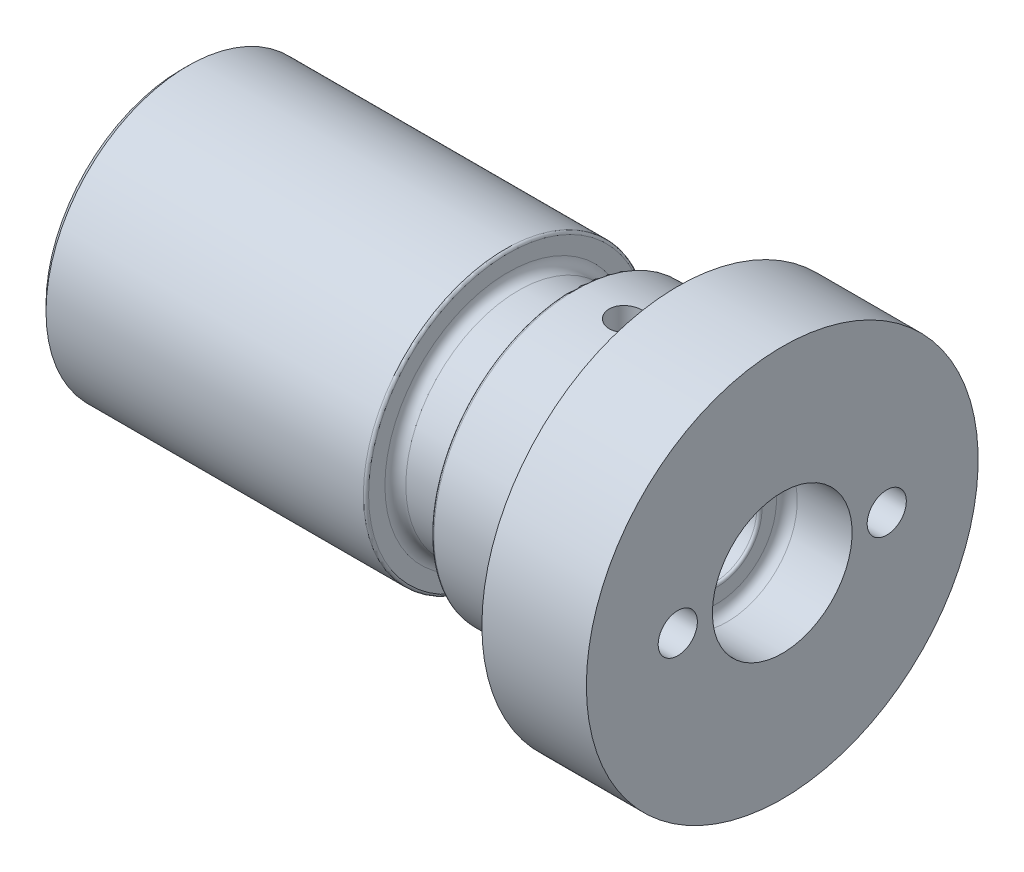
ISO-10303-21;
HEADER;
FILE_DESCRIPTION(('STEP AP214'),'2;1');
FILE_NAME('part.step','',(''),(''),'','','');
FILE_SCHEMA(('AUTOMOTIVE_DESIGN { 1 0 10303 214 1 1 1 1 }'));
ENDSEC;
DATA;
#1=APPLICATION_CONTEXT('core data for automotive mechanical design processes');
#2=APPLICATION_PROTOCOL_DEFINITION('international standard','automotive_design',2000,#1);
#3=PRODUCT_CONTEXT('',#1,'mechanical');
#4=PRODUCT('Part','Part','',(#3));
#5=PRODUCT_RELATED_PRODUCT_CATEGORY('part','',(#4));
#6=PRODUCT_DEFINITION_FORMATION('','',#4);
#7=PRODUCT_DEFINITION_CONTEXT('part definition',#1,'design');
#8=PRODUCT_DEFINITION('design','',#6,#7);
#9=PRODUCT_DEFINITION_SHAPE('','',#8);
#10=(LENGTH_UNIT() NAMED_UNIT(*) SI_UNIT(.MILLI.,.METRE.));
#11=(NAMED_UNIT(*) PLANE_ANGLE_UNIT() SI_UNIT($,.RADIAN.));
#12=(NAMED_UNIT(*) SI_UNIT($,.STERADIAN.) SOLID_ANGLE_UNIT());
#13=UNCERTAINTY_MEASURE_WITH_UNIT(LENGTH_MEASURE(1.E-05),#10,'distance_accuracy_value','');
#14=(GEOMETRIC_REPRESENTATION_CONTEXT(3) GLOBAL_UNCERTAINTY_ASSIGNED_CONTEXT((#13)) GLOBAL_UNIT_ASSIGNED_CONTEXT((#10,
#11,#12)) REPRESENTATION_CONTEXT('',''));
#15=CARTESIAN_POINT('',(0.,0.,0.));
#16=DIRECTION('',(0.,0.,1.));
#17=DIRECTION('',(1.,0.,0.));
#18=AXIS2_PLACEMENT_3D('',#15,#16,#17);
#19=CARTESIAN_POINT('',(0.,0.,0.));
#20=DIRECTION('',(-1.00000000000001,0.,0.));
#21=DIRECTION('',(0.,0.,1.));
#22=AXIS2_PLACEMENT_3D('',#19,#20,#21);
#23=CYLINDRICAL_SURFACE('',#22,10.875);
#24=CARTESIAN_POINT('',(24.8000000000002,0.,0.));
#25=DIRECTION('',(-1.00000000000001,0.,0.));
#26=DIRECTION('',(0.,0.,1.));
#27=AXIS2_PLACEMENT_3D('',#24,#25,#26);
#28=CIRCLE('',#27,10.875);
#29=CARTESIAN_POINT('',(24.8000000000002,0.,10.875));
#30=VERTEX_POINT('',#29);
#31=EDGE_CURVE('E203',#30,#30,#28,.T.);
#32=ORIENTED_EDGE('',*,*,#31,.T.);
#33=EDGE_LOOP('',(#32));
#34=FACE_BOUND('',#33,.T.);
#35=CARTESIAN_POINT('',(0.5,0.,0.));
#36=DIRECTION('',(1.00000000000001,0.,0.));
#37=DIRECTION('',(0.,0.,-1.));
#38=AXIS2_PLACEMENT_3D('',#35,#36,#37);
#39=CIRCLE('',#38,10.875);
#40=CARTESIAN_POINT('',(0.500000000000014,0.,-10.875));
#41=VERTEX_POINT('',#40);
#42=EDGE_CURVE('E206',#41,#41,#39,.T.);
#43=ORIENTED_EDGE('',*,*,#42,.T.);
#44=EDGE_LOOP('',(#43));
#45=FACE_BOUND('',#44,.T.);
#46=ADVANCED_FACE('F40',(#34,#45),#23,.T.);
#47=CARTESIAN_POINT('',(25.0000000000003,10.875,0.));
#48=DIRECTION('',(-1.00000000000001,0.,0.));
#49=DIRECTION('',(0.,0.,1.));
#50=AXIS2_PLACEMENT_3D('',#47,#48,#49);
#51=PLANE('',#50);
#52=CARTESIAN_POINT('',(25.0000000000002,0.,0.));
#53=DIRECTION('',(-1.00000000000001,0.,0.));
#54=DIRECTION('',(0.,0.,1.));
#55=AXIS2_PLACEMENT_3D('',#52,#53,#54);
#56=CIRCLE('',#55,10.675);
#57=CARTESIAN_POINT('',(25.0000000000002,0.,10.675));
#58=VERTEX_POINT('',#57);
#59=EDGE_CURVE('E373',#58,#58,#56,.F.);
#60=ORIENTED_EDGE('',*,*,#59,.T.);
#61=EDGE_LOOP('',(#60));
#62=FACE_BOUND('',#61,.T.);
#63=CARTESIAN_POINT('',(25.0000000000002,0.,0.));
#64=DIRECTION('',(-1.00000000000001,0.,0.));
#65=DIRECTION('',(0.,0.,1.));
#66=AXIS2_PLACEMENT_3D('',#63,#64,#65);
#67=CIRCLE('',#66,9.425);
#68=CARTESIAN_POINT('',(25.0000000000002,0.,9.42499999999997));
#69=VERTEX_POINT('',#68);
#70=EDGE_CURVE('E355',#69,#69,#67,.T.);
#71=ORIENTED_EDGE('',*,*,#70,.T.);
#72=EDGE_LOOP('',(#71));
#73=FACE_BOUND('',#72,.T.);
#74=ADVANCED_FACE('F193',(#62,#73),#51,.F.);
#75=CARTESIAN_POINT('',(0.,0.,0.));
#76=DIRECTION('',(-1.00000000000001,0.,0.));
#77=DIRECTION('',(0.,0.,1.));
#78=AXIS2_PLACEMENT_3D('',#75,#76,#77);
#79=CYLINDRICAL_SURFACE('',#78,8.625);
#80=CARTESIAN_POINT('',(29.2000000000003,0.,0.));
#81=DIRECTION('',(1.00000000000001,0.,0.));
#82=DIRECTION('',(0.,0.,-1.));
#83=AXIS2_PLACEMENT_3D('',#80,#81,#82);
#84=CIRCLE('',#83,8.625);
#85=CARTESIAN_POINT('',(29.2000000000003,0.,-8.62500000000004));
#86=VERTEX_POINT('',#85);
#87=EDGE_CURVE('E212',#86,#86,#84,.F.);
#88=ORIENTED_EDGE('',*,*,#87,.T.);
#89=EDGE_LOOP('',(#88));
#90=FACE_BOUND('',#89,.T.);
#91=CARTESIAN_POINT('',(25.8000000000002,0.,0.));
#92=DIRECTION('',(-1.00000000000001,0.,0.));
#93=DIRECTION('',(0.,0.,1.));
#94=AXIS2_PLACEMENT_3D('',#91,#92,#93);
#95=CIRCLE('',#94,8.625);
#96=CARTESIAN_POINT('',(25.8000000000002,0.,8.62499999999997));
#97=VERTEX_POINT('',#96);
#98=EDGE_CURVE('E208',#97,#97,#95,.F.);
#99=ORIENTED_EDGE('',*,*,#98,.T.);
#100=EDGE_LOOP('',(#99));
#101=FACE_BOUND('',#100,.T.);
#102=ADVANCED_FACE('F198',(#90,#101),#79,.T.);
#103=CARTESIAN_POINT('',(30.0000000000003,8.62500000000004,0.));
#104=DIRECTION('',(1.00000000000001,0.,0.));
#105=DIRECTION('',(0.,0.,-1.));
#106=AXIS2_PLACEMENT_3D('',#103,#104,#105);
#107=PLANE('',#106);
#108=CARTESIAN_POINT('',(30.0000000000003,0.,0.));
#109=DIRECTION('',(1.00000000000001,0.,0.));
#110=DIRECTION('',(0.,0.,-1.));
#111=AXIS2_PLACEMENT_3D('',#108,#109,#110);
#112=CIRCLE('',#111,10.675);
#113=CARTESIAN_POINT('',(30.0000000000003,0.,-10.675));
#114=VERTEX_POINT('',#113);
#115=EDGE_CURVE('E47',#114,#114,#112,.F.);
#116=ORIENTED_EDGE('',*,*,#115,.T.);
#117=EDGE_LOOP('',(#116));
#118=FACE_BOUND('',#117,.T.);
#119=CARTESIAN_POINT('',(30.0000000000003,0.,0.));
#120=DIRECTION('',(1.00000000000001,0.,0.));
#121=DIRECTION('',(0.,0.,-1.));
#122=AXIS2_PLACEMENT_3D('',#119,#120,#121);
#123=CIRCLE('',#122,9.425);
#124=CARTESIAN_POINT('',(30.0000000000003,0.,-9.42500000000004));
#125=VERTEX_POINT('',#124);
#126=EDGE_CURVE('E351',#125,#125,#123,.T.);
#127=ORIENTED_EDGE('',*,*,#126,.T.);
#128=EDGE_LOOP('',(#127));
#129=FACE_BOUND('',#128,.T.);
#130=ADVANCED_FACE('F280',(#118,#129),#107,.F.);
#131=CARTESIAN_POINT('',(0.,0.,0.));
#132=DIRECTION('',(-1.00000000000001,0.,0.));
#133=DIRECTION('',(0.,0.,1.));
#134=AXIS2_PLACEMENT_3D('',#131,#132,#133);
#135=CYLINDRICAL_SURFACE('',#134,10.875);
#136=CARTESIAN_POINT('',(30.2000000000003,0.,0.));
#137=DIRECTION('',(1.00000000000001,0.,0.));
#138=DIRECTION('',(0.,0.,-1.));
#139=AXIS2_PLACEMENT_3D('',#136,#137,#138);
#140=CIRCLE('',#139,10.875);
#141=CARTESIAN_POINT('',(30.2000000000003,0.,-10.875));
#142=VERTEX_POINT('',#141);
#143=EDGE_CURVE('E11',#142,#142,#140,.T.);
#144=ORIENTED_EDGE('',*,*,#143,.T.);
#145=EDGE_LOOP('',(#144));
#146=FACE_BOUND('',#145,.T.);
#147=CARTESIAN_POINT('',(34.0000000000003,-10.8029220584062,-1.25000000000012));
#148=CARTESIAN_POINT('',(33.9300362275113,-10.8029229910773,-1.24999699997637));
#149=CARTESIAN_POINT('',(33.8600276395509,-10.8036090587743,-1.24410628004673));
#150=CARTESIAN_POINT('',(33.7219556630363,-10.8062784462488,-1.22069838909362));
#151=CARTESIAN_POINT('',(33.6538944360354,-10.8082631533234,-1.20316878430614));
#152=CARTESIAN_POINT('',(33.5217364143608,-10.8133021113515,-1.15700398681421));
#153=CARTESIAN_POINT('',(33.457637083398,-10.8163556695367,-1.12837598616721));
#154=CARTESIAN_POINT('',(33.3351655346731,-10.8231874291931,-1.06084179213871));
#155=CARTESIAN_POINT('',(33.2767922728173,-10.8269654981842,-1.02193747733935));
#156=CARTESIAN_POINT('',(33.167139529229,-10.8348407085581,-0.93475663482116));
#157=CARTESIAN_POINT('',(33.1158911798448,-10.838939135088,-0.886441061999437));
#158=CARTESIAN_POINT('',(33.0222115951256,-10.8469816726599,-0.781893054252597));
#159=CARTESIAN_POINT('',(32.9797807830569,-10.8509257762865,-0.725660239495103));
#160=CARTESIAN_POINT('',(32.9048305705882,-10.8582282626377,-0.606680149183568));
#161=CARTESIAN_POINT('',(32.8723391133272,-10.8615849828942,-0.543915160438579));
#162=CARTESIAN_POINT('',(32.818368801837,-10.8673204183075,-0.413774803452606));
#163=CARTESIAN_POINT('',(32.7968895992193,-10.8696991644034,-0.346399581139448));
#164=CARTESIAN_POINT('',(32.7656458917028,-10.8732015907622,-0.209268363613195));
#165=CARTESIAN_POINT('',(32.7558298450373,-10.8743307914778,-0.139524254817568));
#166=CARTESIAN_POINT('',(32.7480314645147,-10.8752257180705,0.000629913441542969));
#167=CARTESIAN_POINT('',(32.7500487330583,-10.8749914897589,0.0710399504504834));
#168=CARTESIAN_POINT('',(32.7658181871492,-10.8731904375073,0.210176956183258));
#169=CARTESIAN_POINT('',(32.7795149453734,-10.871629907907,0.278910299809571));
#170=CARTESIAN_POINT('',(32.8181680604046,-10.8673587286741,0.413096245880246));
#171=CARTESIAN_POINT('',(32.8431246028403,-10.8646480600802,0.478548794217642));
#172=CARTESIAN_POINT('',(32.9036485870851,-10.8583704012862,0.604488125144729));
#173=CARTESIAN_POINT('',(32.9392402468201,-10.8548014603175,0.664963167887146));
#174=CARTESIAN_POINT('',(33.0200065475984,-10.8472070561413,0.779102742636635));
#175=CARTESIAN_POINT('',(33.0651815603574,-10.8431815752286,0.832767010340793));
#176=CARTESIAN_POINT('',(33.16414321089,-10.8350976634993,0.932086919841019));
#177=CARTESIAN_POINT('',(33.2179781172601,-10.8310391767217,0.977694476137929));
#178=CARTESIAN_POINT('',(33.3325649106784,-10.8233697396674,1.05923323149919));
#179=CARTESIAN_POINT('',(33.3933168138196,-10.819758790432,1.09516440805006));
#180=CARTESIAN_POINT('',(33.5200533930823,-10.8133931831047,1.15633191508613));
#181=CARTESIAN_POINT('',(33.5860397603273,-10.8106388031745,1.18156477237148));
#182=CARTESIAN_POINT('',(33.7213516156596,-10.8063037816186,1.22057870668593));
#183=CARTESIAN_POINT('',(33.790676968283,-10.8047230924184,1.2343602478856));
#184=CARTESIAN_POINT('',(33.9302753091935,-10.8029229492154,1.25001744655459));
#185=CARTESIAN_POINT('',(34.0005406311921,-10.8026957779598,1.25196060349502));
#186=CARTESIAN_POINT('',(34.1403958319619,-10.8036080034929,1.24406361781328));
#187=CARTESIAN_POINT('',(34.2099857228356,-10.80474737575,1.23422368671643));
#188=CARTESIAN_POINT('',(34.3463147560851,-10.808257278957,1.20309652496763));
#189=CARTESIAN_POINT('',(34.4130613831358,-10.8106243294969,1.1818416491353));
#190=CARTESIAN_POINT('',(34.5420427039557,-10.8163200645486,1.12852113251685));
#191=CARTESIAN_POINT('',(34.6042772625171,-10.8196487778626,1.09645516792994));
#192=CARTESIAN_POINT('',(34.7227742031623,-10.82691135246,1.02225540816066));
#193=CARTESIAN_POINT('',(34.7790085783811,-10.8308478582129,0.980077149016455));
#194=CARTESIAN_POINT('',(34.8836238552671,-10.8388740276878,0.886913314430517));
#195=CARTESIAN_POINT('',(34.9320044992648,-10.8429636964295,0.83592745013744));
#196=CARTESIAN_POINT('',(35.0197742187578,-10.8508589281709,0.726301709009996));
#197=CARTESIAN_POINT('',(35.0591190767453,-10.8546630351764,0.667626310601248));
#198=CARTESIAN_POINT('',(35.12739513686,-10.8615370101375,0.544460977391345));
#199=CARTESIAN_POINT('',(35.1563265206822,-10.8646068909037,0.479971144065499));
#200=CARTESIAN_POINT('',(35.2028805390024,-10.8696600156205,0.34715767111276));
#201=CARTESIAN_POINT('',(35.2205292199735,-10.8716457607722,0.278843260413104));
#202=CARTESIAN_POINT('',(35.2441017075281,-10.8743172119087,0.140196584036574));
#203=CARTESIAN_POINT('',(35.2500259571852,-10.8750029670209,0.0698643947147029));
#204=CARTESIAN_POINT('',(35.2499740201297,-10.8749970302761,-0.070388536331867));
#205=CARTESIAN_POINT('',(35.2440662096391,-10.8743132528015,-0.140309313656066));
#206=CARTESIAN_POINT('',(35.2206620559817,-10.8716607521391,-0.278157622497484));
#207=CARTESIAN_POINT('',(35.2031657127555,-10.8696920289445,-0.346085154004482));
#208=CARTESIAN_POINT('',(35.1571015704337,-10.8646899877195,-0.47801335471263));
#209=CARTESIAN_POINT('',(35.1285365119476,-10.8616569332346,-0.54201499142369));
#210=CARTESIAN_POINT('',(35.0611529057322,-10.8548630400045,-0.664326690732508));
#211=CARTESIAN_POINT('',(35.0223343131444,-10.8511021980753,-0.722636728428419));
#212=CARTESIAN_POINT('',(34.9352908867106,-10.8432472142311,-0.832259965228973));
#213=CARTESIAN_POINT('',(34.8870151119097,-10.8391513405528,-0.883532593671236));
#214=CARTESIAN_POINT('',(34.7825319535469,-10.831102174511,-0.977277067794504));
#215=CARTESIAN_POINT('',(34.726322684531,-10.8271489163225,-1.01974681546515));
#216=CARTESIAN_POINT('',(34.6073597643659,-10.8198187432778,-1.09479596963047));
#217=CARTESIAN_POINT('',(34.5445852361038,-10.8164437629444,-1.12734245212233));
#218=CARTESIAN_POINT('',(34.4144602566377,-10.8106750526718,-1.18138701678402));
#219=CARTESIAN_POINT('',(34.3471149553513,-10.8082802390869,-1.2028973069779));
#220=CARTESIAN_POINT('',(34.2328388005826,-10.8053341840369,-1.2290167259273));
#221=CARTESIAN_POINT('',(34.1866332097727,-10.804434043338,-1.23687438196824));
#222=CARTESIAN_POINT('',(34.0936251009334,-10.8032276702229,-1.24736700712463));
#223=CARTESIAN_POINT('',(34.0468225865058,-10.802921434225,-1.25000200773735));
#224=CARTESIAN_POINT('',(34.0000000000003,-10.8029220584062,-1.25000000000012));
#225=B_SPLINE_CURVE_WITH_KNOTS('',3,(#147,#148,#149,#150,#151,#152,#153,#154,#155,#156,#157,
#158,#159,#160,#161,#162,#163,#164,#165,#166,#167,#168,#169,#170,#171,#172,#173,#174,#175,#176,
#177,#178,#179,#180,#181,#182,#183,#184,#185,#186,#187,#188,#189,#190,#191,#192,#193,#194,#195,
#196,#197,#198,#199,#200,#201,#202,#203,#204,#205,#206,#207,#208,#209,#210,#211,#212,#213,#214,
#215,#216,#217,#218,#219,#220,#221,#222,#223,#224),.UNSPECIFIED.,.T.,.F.,(4,2,2,2,2,2,2,2,2,2,2,
2,2,2,2,2,2,2,2,2,2,2,2,2,2,2,2,2,2,2,2,2,2,2,2,2,2,2,4),(0.,0.209720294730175,
0.419664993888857,0.629473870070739,0.839244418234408,1.04990454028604,1.26057477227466,
1.47183194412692,1.68308243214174,1.89339584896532,2.10370219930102,2.31301601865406,
2.52233328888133,2.73213088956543,2.94193662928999,3.1529551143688,3.3639740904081,
3.57506152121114,3.78614039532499,3.99601461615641,4.20588506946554,4.4151637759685,
4.62444875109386,4.83467140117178,5.04490094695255,5.25613833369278,5.46737203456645,
5.67811631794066,5.88885263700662,6.09837464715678,6.30789665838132,6.51736682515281,
6.72683790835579,6.93746996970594,7.14815217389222,7.35952597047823,7.57066544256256,
7.71101959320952,7.85137289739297),.UNSPECIFIED.);
#226=CARTESIAN_POINT('',(34.0000000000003,-10.8029220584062,-1.25000000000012));
#227=VERTEX_POINT('',#226);
#228=EDGE_CURVE('E131',#227,#227,#225,.T.);
#229=ORIENTED_EDGE('',*,*,#228,.T.);
#230=EDGE_LOOP('',(#229));
#231=FACE_BOUND('',#230,.T.);
#232=CARTESIAN_POINT('',(34.0000000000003,10.8029220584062,1.24999999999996));
#233=CARTESIAN_POINT('',(33.9300362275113,10.8029229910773,1.24999699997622));
#234=CARTESIAN_POINT('',(33.8600276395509,10.8036090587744,1.24410628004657));
#235=CARTESIAN_POINT('',(33.7219556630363,10.8062784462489,1.22069838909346));
#236=CARTESIAN_POINT('',(33.6538944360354,10.8082631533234,1.20316878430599));
#237=CARTESIAN_POINT('',(33.5217364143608,10.8133021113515,1.15700398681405));
#238=CARTESIAN_POINT('',(33.457637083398,10.8163556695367,1.12837598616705));
#239=CARTESIAN_POINT('',(33.3351655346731,10.8231874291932,1.06084179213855));
#240=CARTESIAN_POINT('',(33.2767922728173,10.8269654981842,1.02193747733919));
#241=CARTESIAN_POINT('',(33.167139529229,10.8348407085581,0.934756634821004));
#242=CARTESIAN_POINT('',(33.1158911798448,10.8389391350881,0.886441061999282));
#243=CARTESIAN_POINT('',(33.0222115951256,10.8469816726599,0.78189305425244));
#244=CARTESIAN_POINT('',(32.9797807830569,10.8509257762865,0.725660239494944));
#245=CARTESIAN_POINT('',(32.9048305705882,10.8582282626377,0.606680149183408));
#246=CARTESIAN_POINT('',(32.8723391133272,10.8615849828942,0.543915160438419));
#247=CARTESIAN_POINT('',(32.818368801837,10.8673204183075,0.413774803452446));
#248=CARTESIAN_POINT('',(32.7968895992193,10.8696991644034,0.346399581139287));
#249=CARTESIAN_POINT('',(32.7656458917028,10.8732015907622,0.209268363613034));
#250=CARTESIAN_POINT('',(32.7558298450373,10.8743307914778,0.139524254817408));
#251=CARTESIAN_POINT('',(32.7480314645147,10.8752257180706,-0.000629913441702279));
#252=CARTESIAN_POINT('',(32.7500487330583,10.8749914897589,-0.0710399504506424));
#253=CARTESIAN_POINT('',(32.7658181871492,10.8731904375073,-0.210176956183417));
#254=CARTESIAN_POINT('',(32.7795149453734,10.8716299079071,-0.278910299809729));
#255=CARTESIAN_POINT('',(32.8181680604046,10.8673587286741,-0.413096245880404));
#256=CARTESIAN_POINT('',(32.8431246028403,10.8646480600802,-0.478548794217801));
#257=CARTESIAN_POINT('',(32.9036485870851,10.8583704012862,-0.604488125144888));
#258=CARTESIAN_POINT('',(32.9392402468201,10.8548014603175,-0.664963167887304));
#259=CARTESIAN_POINT('',(33.0200065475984,10.8472070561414,-0.779102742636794));
#260=CARTESIAN_POINT('',(33.0651815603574,10.8431815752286,-0.832767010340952));
#261=CARTESIAN_POINT('',(33.16414321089,10.8350976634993,-0.932086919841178));
#262=CARTESIAN_POINT('',(33.2179781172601,10.8310391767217,-0.977694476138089));
#263=CARTESIAN_POINT('',(33.3325649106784,10.8233697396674,-1.05923323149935));
#264=CARTESIAN_POINT('',(33.3933168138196,10.819758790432,-1.09516440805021));
#265=CARTESIAN_POINT('',(33.5200533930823,10.8133931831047,-1.15633191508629));
#266=CARTESIAN_POINT('',(33.5860397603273,10.8106388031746,-1.18156477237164));
#267=CARTESIAN_POINT('',(33.7213516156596,10.8063037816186,-1.22057870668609));
#268=CARTESIAN_POINT('',(33.790676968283,10.8047230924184,-1.23436024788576));
#269=CARTESIAN_POINT('',(33.9302753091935,10.8029229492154,-1.25001744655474));
#270=CARTESIAN_POINT('',(34.0005406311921,10.8026957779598,-1.25196060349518));
#271=CARTESIAN_POINT('',(34.1403958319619,10.8036080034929,-1.24406361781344));
#272=CARTESIAN_POINT('',(34.2099857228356,10.80474737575,-1.23422368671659));
#273=CARTESIAN_POINT('',(34.3463147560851,10.808257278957,-1.20309652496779));
#274=CARTESIAN_POINT('',(34.4130613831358,10.8106243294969,-1.18184164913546));
#275=CARTESIAN_POINT('',(34.5420427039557,10.8163200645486,-1.12852113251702));
#276=CARTESIAN_POINT('',(34.6042772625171,10.8196487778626,-1.09645516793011));
#277=CARTESIAN_POINT('',(34.7227742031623,10.82691135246,-1.02225540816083));
#278=CARTESIAN_POINT('',(34.7790085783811,10.8308478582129,-0.980077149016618));
#279=CARTESIAN_POINT('',(34.883623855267,10.8388740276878,-0.886913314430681));
#280=CARTESIAN_POINT('',(34.9320044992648,10.8429636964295,-0.835927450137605));
#281=CARTESIAN_POINT('',(35.0197742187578,10.8508589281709,-0.726301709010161));
#282=CARTESIAN_POINT('',(35.0591190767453,10.8546630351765,-0.667626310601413));
#283=CARTESIAN_POINT('',(35.12739513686,10.8615370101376,-0.544460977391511));
#284=CARTESIAN_POINT('',(35.1563265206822,10.8646068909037,-0.479971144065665));
#285=CARTESIAN_POINT('',(35.2028805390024,10.8696600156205,-0.347157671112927));
#286=CARTESIAN_POINT('',(35.2205292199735,10.8716457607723,-0.278843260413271));
#287=CARTESIAN_POINT('',(35.2441017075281,10.8743172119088,-0.14019658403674));
#288=CARTESIAN_POINT('',(35.2500259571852,10.8750029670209,-0.0698643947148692));
#289=CARTESIAN_POINT('',(35.2499740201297,10.8749970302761,0.0703885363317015));
#290=CARTESIAN_POINT('',(35.2440662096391,10.8743132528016,0.140309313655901));
#291=CARTESIAN_POINT('',(35.2206620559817,10.8716607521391,0.278157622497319));
#292=CARTESIAN_POINT('',(35.2031657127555,10.8696920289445,0.346085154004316));
#293=CARTESIAN_POINT('',(35.1571015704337,10.8646899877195,0.478013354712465));
#294=CARTESIAN_POINT('',(35.1285365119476,10.8616569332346,0.542014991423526));
#295=CARTESIAN_POINT('',(35.0611529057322,10.8548630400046,0.664326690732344));
#296=CARTESIAN_POINT('',(35.0223343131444,10.8511021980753,0.722636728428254));
#297=CARTESIAN_POINT('',(34.9352908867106,10.8432472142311,0.832259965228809));
#298=CARTESIAN_POINT('',(34.8870151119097,10.8391513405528,0.883532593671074));
#299=CARTESIAN_POINT('',(34.7825319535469,10.8311021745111,0.977277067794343));
#300=CARTESIAN_POINT('',(34.726322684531,10.8271489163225,1.01974681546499));
#301=CARTESIAN_POINT('',(34.6073597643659,10.8198187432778,1.09479596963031));
#302=CARTESIAN_POINT('',(34.5445852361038,10.8164437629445,1.12734245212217));
#303=CARTESIAN_POINT('',(34.4144602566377,10.8106750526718,1.18138701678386));
#304=CARTESIAN_POINT('',(34.3471149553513,10.8082802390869,1.20289730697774));
#305=CARTESIAN_POINT('',(34.2328388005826,10.8053341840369,1.22901672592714));
#306=CARTESIAN_POINT('',(34.1866332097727,10.804434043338,1.23687438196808));
#307=CARTESIAN_POINT('',(34.0936251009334,10.8032276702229,1.24736700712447));
#308=CARTESIAN_POINT('',(34.0468225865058,10.8029214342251,1.25000200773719));
#309=CARTESIAN_POINT('',(34.0000000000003,10.8029220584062,1.24999999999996));
#310=B_SPLINE_CURVE_WITH_KNOTS('',3,(#232,#233,#234,#235,#236,#237,#238,#239,#240,#241,#242,
#243,#244,#245,#246,#247,#248,#249,#250,#251,#252,#253,#254,#255,#256,#257,#258,#259,#260,#261,
#262,#263,#264,#265,#266,#267,#268,#269,#270,#271,#272,#273,#274,#275,#276,#277,#278,#279,#280,
#281,#282,#283,#284,#285,#286,#287,#288,#289,#290,#291,#292,#293,#294,#295,#296,#297,#298,#299,
#300,#301,#302,#303,#304,#305,#306,#307,#308,#309),.UNSPECIFIED.,.T.,.F.,(4,2,2,2,2,2,2,2,2,2,2,
2,2,2,2,2,2,2,2,2,2,2,2,2,2,2,2,2,2,2,2,2,2,2,2,2,2,2,4),(0.,0.209720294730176,
0.419664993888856,0.629473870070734,0.839244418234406,1.04990454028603,1.26057477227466,
1.47183194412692,1.68308243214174,1.89339584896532,2.10370219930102,2.31301601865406,
2.52233328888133,2.73213088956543,2.94193662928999,3.15295511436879,3.3639740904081,
3.57506152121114,3.78614039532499,3.99601461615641,4.20588506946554,4.4151637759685,
4.62444875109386,4.83467140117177,5.04490094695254,5.25613833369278,5.46737203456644,
5.67811631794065,5.88885263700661,6.09837464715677,6.30789665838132,6.51736682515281,
6.72683790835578,6.93746996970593,7.14815217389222,7.35952597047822,7.57066544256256,
7.71101959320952,7.85137289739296),.UNSPECIFIED.);
#311=CARTESIAN_POINT('',(34.0000000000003,10.8029220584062,1.24999999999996));
#312=VERTEX_POINT('',#311);
#313=EDGE_CURVE('E219',#312,#312,#310,.T.);
#314=ORIENTED_EDGE('',*,*,#313,.T.);
#315=EDGE_LOOP('',(#314));
#316=FACE_BOUND('',#315,.T.);
#317=CARTESIAN_POINT('',(38.0000000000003,0.,0.));
#318=DIRECTION('',(-1.00000000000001,0.,0.));
#319=DIRECTION('',(0.,0.,1.));
#320=AXIS2_PLACEMENT_3D('',#317,#318,#319);
#321=CIRCLE('',#320,10.875);
#322=CARTESIAN_POINT('',(38.0000000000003,0.,10.8749999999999));
#323=VERTEX_POINT('',#322);
#324=EDGE_CURVE('E215',#323,#323,#321,.T.);
#325=ORIENTED_EDGE('',*,*,#324,.T.);
#326=EDGE_LOOP('',(#325));
#327=FACE_BOUND('',#326,.T.);
#328=ADVANCED_FACE('F229',(#146,#231,#316,#327),#135,.T.);
#329=CARTESIAN_POINT('',(38.0000000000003,10.875,0.));
#330=DIRECTION('',(1.00000000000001,0.,0.));
#331=DIRECTION('',(0.,0.,-1.));
#332=AXIS2_PLACEMENT_3D('',#329,#330,#331);
#333=PLANE('',#332);
#334=ORIENTED_EDGE('',*,*,#324,.F.);
#335=EDGE_LOOP('',(#334));
#336=FACE_BOUND('',#335,.T.);
#337=CARTESIAN_POINT('',(38.0000000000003,0.,0.));
#338=DIRECTION('',(-1.00000000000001,0.,0.));
#339=DIRECTION('',(0.,0.,1.));
#340=AXIS2_PLACEMENT_3D('',#337,#338,#339);
#341=CIRCLE('',#340,15.);
#342=CARTESIAN_POINT('',(38.0000000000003,0.,14.9999999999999));
#343=VERTEX_POINT('',#342);
#344=EDGE_CURVE('E287',#343,#343,#341,.T.);
#345=ORIENTED_EDGE('',*,*,#344,.T.);
#346=EDGE_LOOP('',(#345));
#347=FACE_BOUND('',#346,.T.);
#348=ADVANCED_FACE('F273',(#336,#347),#333,.F.);
#349=CARTESIAN_POINT('',(0.,0.,0.));
#350=DIRECTION('',(-1.00000000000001,0.,0.));
#351=DIRECTION('',(0.,0.,1.));
#352=AXIS2_PLACEMENT_3D('',#349,#350,#351);
#353=CYLINDRICAL_SURFACE('',#352,15.);
#354=ORIENTED_EDGE('',*,*,#344,.F.);
#355=EDGE_LOOP('',(#354));
#356=FACE_BOUND('',#355,.T.);
#357=CARTESIAN_POINT('',(46.0000000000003,0.,0.));
#358=DIRECTION('',(-1.00000000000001,0.,0.));
#359=DIRECTION('',(0.,0.,1.));
#360=AXIS2_PLACEMENT_3D('',#357,#358,#359);
#361=CIRCLE('',#360,15.);
#362=CARTESIAN_POINT('',(46.0000000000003,0.,14.9999999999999));
#363=VERTEX_POINT('',#362);
#364=EDGE_CURVE('E288',#363,#363,#361,.T.);
#365=ORIENTED_EDGE('',*,*,#364,.T.);
#366=EDGE_LOOP('',(#365));
#367=FACE_BOUND('',#366,.T.);
#368=ADVANCED_FACE('F270',(#356,#367),#353,.T.);
#369=CARTESIAN_POINT('',(46.0000000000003,15.,0.));
#370=DIRECTION('',(-1.00000000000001,0.,0.));
#371=DIRECTION('',(0.,0.,1.));
#372=AXIS2_PLACEMENT_3D('',#369,#370,#371);
#373=PLANE('',#372);
#374=CARTESIAN_POINT('',(46.0000000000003,0.,7.99999999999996));
#375=DIRECTION('',(1.00000000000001,0.,0.));
#376=DIRECTION('',(0.,0.,-1.));
#377=AXIS2_PLACEMENT_3D('',#374,#375,#376);
#378=CIRCLE('',#377,1.5);
#379=CARTESIAN_POINT('',(46.0000000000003,0.,6.49999999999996));
#380=VERTEX_POINT('',#379);
#381=EDGE_CURVE('E128',#380,#380,#378,.T.);
#382=ORIENTED_EDGE('',*,*,#381,.F.);
#383=EDGE_LOOP('',(#382));
#384=FACE_BOUND('',#383,.T.);
#385=CARTESIAN_POINT('',(46.0000000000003,0.,-8.00000000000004));
#386=DIRECTION('',(1.00000000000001,0.,0.));
#387=DIRECTION('',(0.,0.,-1.));
#388=AXIS2_PLACEMENT_3D('',#385,#386,#387);
#389=CIRCLE('',#388,1.5);
#390=CARTESIAN_POINT('',(46.0000000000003,0.,-9.50000000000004));
#391=VERTEX_POINT('',#390);
#392=EDGE_CURVE('E305',#391,#391,#389,.T.);
#393=ORIENTED_EDGE('',*,*,#392,.F.);
#394=EDGE_LOOP('',(#393));
#395=FACE_BOUND('',#394,.T.);
#396=ORIENTED_EDGE('',*,*,#364,.F.);
#397=EDGE_LOOP('',(#396));
#398=FACE_BOUND('',#397,.T.);
#399=CARTESIAN_POINT('',(46.0000000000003,0.,0.));
#400=DIRECTION('',(-1.00000000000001,0.,0.));
#401=DIRECTION('',(0.,0.,1.));
#402=AXIS2_PLACEMENT_3D('',#399,#400,#401);
#403=CIRCLE('',#402,5.35);
#404=CARTESIAN_POINT('',(46.0000000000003,0.,5.34999999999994));
#405=VERTEX_POINT('',#404);
#406=EDGE_CURVE('E291',#405,#405,#403,.T.);
#407=ORIENTED_EDGE('',*,*,#406,.T.);
#408=EDGE_LOOP('',(#407));
#409=FACE_BOUND('',#408,.T.);
#410=ADVANCED_FACE('F266',(#384,#395,#398,#409),#373,.F.);
#411=CARTESIAN_POINT('',(0.,0.,0.));
#412=DIRECTION('',(-1.00000000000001,0.,0.));
#413=DIRECTION('',(0.,0.,1.));
#414=AXIS2_PLACEMENT_3D('',#411,#412,#413);
#415=CYLINDRICAL_SURFACE('',#414,5.35);
#416=CARTESIAN_POINT('',(41.8000000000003,0.,0.));
#417=DIRECTION('',(-1.00000000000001,0.,0.));
#418=DIRECTION('',(0.,0.,1.));
#419=AXIS2_PLACEMENT_3D('',#416,#417,#418);
#420=CIRCLE('',#419,5.35);
#421=CARTESIAN_POINT('',(41.8000000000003,0.,5.34999999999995));
#422=VERTEX_POINT('',#421);
#423=EDGE_CURVE('E360',#422,#422,#420,.T.);
#424=ORIENTED_EDGE('',*,*,#423,.T.);
#425=EDGE_LOOP('',(#424));
#426=FACE_BOUND('',#425,.T.);
#427=ORIENTED_EDGE('',*,*,#406,.F.);
#428=EDGE_LOOP('',(#427));
#429=FACE_BOUND('',#428,.T.);
#430=ADVANCED_FACE('F262',(#426,#429),#415,.F.);
#431=CARTESIAN_POINT('',(41.0000000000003,3.25000000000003,0.));
#432=DIRECTION('',(-1.00000000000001,0.,0.));
#433=DIRECTION('',(0.,0.,1.));
#434=AXIS2_PLACEMENT_3D('',#431,#432,#433);
#435=PLANE('',#434);
#436=CARTESIAN_POINT('',(41.0000000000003,0.,0.));
#437=DIRECTION('',(-1.00000000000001,0.,0.));
#438=DIRECTION('',(0.,0.,1.));
#439=AXIS2_PLACEMENT_3D('',#436,#437,#438);
#440=CIRCLE('',#439,3.45);
#441=CARTESIAN_POINT('',(41.0000000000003,0.,3.44999999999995));
#442=VERTEX_POINT('',#441);
#443=EDGE_CURVE('E366',#442,#442,#440,.T.);
#444=ORIENTED_EDGE('',*,*,#443,.T.);
#445=EDGE_LOOP('',(#444));
#446=FACE_BOUND('',#445,.T.);
#447=CARTESIAN_POINT('',(41.0000000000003,0.,0.));
#448=DIRECTION('',(-1.00000000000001,0.,0.));
#449=DIRECTION('',(0.,0.,1.));
#450=AXIS2_PLACEMENT_3D('',#447,#448,#449);
#451=CIRCLE('',#450,4.55);
#452=CARTESIAN_POINT('',(41.0000000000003,0.,4.54999999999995));
#453=VERTEX_POINT('',#452);
#454=EDGE_CURVE('E98',#453,#453,#451,.F.);
#455=ORIENTED_EDGE('',*,*,#454,.T.);
#456=EDGE_LOOP('',(#455));
#457=FACE_BOUND('',#456,.T.);
#458=ADVANCED_FACE('F258',(#446,#457),#435,.F.);
#459=CARTESIAN_POINT('',(0.,0.,0.));
#460=DIRECTION('',(-1.00000000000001,0.,0.));
#461=DIRECTION('',(0.,0.,1.));
#462=AXIS2_PLACEMENT_3D('',#459,#460,#461);
#463=CYLINDRICAL_SURFACE('',#462,3.25);
#464=CARTESIAN_POINT('',(40.8000000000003,0.,0.));
#465=DIRECTION('',(-1.00000000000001,0.,0.));
#466=DIRECTION('',(0.,0.,1.));
#467=AXIS2_PLACEMENT_3D('',#464,#465,#466);
#468=CIRCLE('',#467,3.25);
#469=CARTESIAN_POINT('',(40.8000000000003,0.,3.24999999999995));
#470=VERTEX_POINT('',#469);
#471=EDGE_CURVE('E369',#470,#470,#468,.F.);
#472=ORIENTED_EDGE('',*,*,#471,.T.);
#473=EDGE_LOOP('',(#472));
#474=FACE_BOUND('',#473,.T.);
#475=CARTESIAN_POINT('',(31.5000000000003,0.,0.));
#476=DIRECTION('',(-1.00000000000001,0.,0.));
#477=DIRECTION('',(0.,0.,1.));
#478=AXIS2_PLACEMENT_3D('',#475,#476,#477);
#479=CIRCLE('',#478,3.25);
#480=CARTESIAN_POINT('',(31.5000000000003,0.,3.24999999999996));
#481=VERTEX_POINT('',#480);
#482=EDGE_CURVE('E296',#481,#481,#479,.T.);
#483=ORIENTED_EDGE('',*,*,#482,.T.);
#484=EDGE_LOOP('',(#483));
#485=FACE_BOUND('',#484,.T.);
#486=ADVANCED_FACE('F254',(#474,#485),#463,.F.);
#487=CARTESIAN_POINT('',(31.5000000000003,3.25000000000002,0.));
#488=DIRECTION('',(1.00000000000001,0.,0.));
#489=DIRECTION('',(0.,0.,-1.));
#490=AXIS2_PLACEMENT_3D('',#487,#488,#489);
#491=PLANE('',#490);
#492=ORIENTED_EDGE('',*,*,#482,.F.);
#493=EDGE_LOOP('',(#492));
#494=FACE_BOUND('',#493,.T.);
#495=CARTESIAN_POINT('',(31.5000000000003,0.,0.));
#496=DIRECTION('',(-1.00000000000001,0.,0.));
#497=DIRECTION('',(0.,0.,1.));
#498=AXIS2_PLACEMENT_3D('',#495,#496,#497);
#499=CIRCLE('',#498,6.);
#500=CARTESIAN_POINT('',(31.5000000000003,0.,5.99999999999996));
#501=VERTEX_POINT('',#500);
#502=EDGE_CURVE('E299',#501,#501,#499,.T.);
#503=ORIENTED_EDGE('',*,*,#502,.T.);
#504=EDGE_LOOP('',(#503));
#505=FACE_BOUND('',#504,.T.);
#506=ADVANCED_FACE('F250',(#494,#505),#491,.F.);
#507=CARTESIAN_POINT('',(0.,0.,0.));
#508=DIRECTION('',(-1.00000000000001,0.,0.));
#509=DIRECTION('',(0.,0.,1.));
#510=AXIS2_PLACEMENT_3D('',#507,#508,#509);
#511=CYLINDRICAL_SURFACE('',#510,6.);
#512=ORIENTED_EDGE('',*,*,#502,.F.);
#513=EDGE_LOOP('',(#512));
#514=FACE_BOUND('',#513,.T.);
#515=CARTESIAN_POINT('',(23.0000000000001,0.,0.));
#516=DIRECTION('',(-1.00000000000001,0.,0.));
#517=DIRECTION('',(0.,0.,1.));
#518=AXIS2_PLACEMENT_3D('',#515,#516,#517);
#519=CIRCLE('',#518,6.);
#520=CARTESIAN_POINT('',(23.0000000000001,5.80296260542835,-1.52500000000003));
#521=VERTEX_POINT('',#520);
#522=CARTESIAN_POINT('',(23.0000000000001,5.80296260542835,1.52499999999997));
#523=VERTEX_POINT('',#522);
#524=EDGE_CURVE('E97',#521,#523,#519,.F.);
#525=ORIENTED_EDGE('',*,*,#524,.F.);
#526=DIRECTION('',(-1.00000000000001,0.,0.));
#527=VECTOR('',#526,1.);
#528=CARTESIAN_POINT('',(0.,5.80296260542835,-1.525));
#529=LINE('',#528,#527);
#530=CARTESIAN_POINT('',(0.,5.80296260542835,-1.525));
#531=VERTEX_POINT('',#530);
#532=EDGE_CURVE('E122',#521,#531,#529,.T.);
#533=ORIENTED_EDGE('',*,*,#532,.T.);
#534=CARTESIAN_POINT('',(0.,0.,0.));
#535=DIRECTION('',(-1.00000000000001,0.,0.));
#536=DIRECTION('',(0.,0.,1.));
#537=AXIS2_PLACEMENT_3D('',#534,#535,#536);
#538=CIRCLE('',#537,6.);
#539=CARTESIAN_POINT('',(0.,5.80296260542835,1.525));
#540=VERTEX_POINT('',#539);
#541=EDGE_CURVE('E226',#531,#540,#538,.T.);
#542=ORIENTED_EDGE('',*,*,#541,.T.);
#543=DIRECTION('',(-1.00000000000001,0.,0.));
#544=VECTOR('',#543,1.);
#545=CARTESIAN_POINT('',(0.,5.80296260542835,1.525));
#546=LINE('',#545,#544);
#547=EDGE_CURVE('E54',#540,#523,#546,.F.);
#548=ORIENTED_EDGE('',*,*,#547,.T.);
#549=EDGE_LOOP('',(#525,#533,#542,#548));
#550=FACE_BOUND('',#549,.T.);
#551=ADVANCED_FACE('F246',(#514,#550),#511,.F.);
#552=CARTESIAN_POINT('',(0.,5.99999999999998,0.));
#553=DIRECTION('',(1.00000000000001,0.,0.));
#554=DIRECTION('',(0.,0.,-1.));
#555=AXIS2_PLACEMENT_3D('',#552,#553,#554);
#556=PLANE('',#555);
#557=CARTESIAN_POINT('',(0.,0.,0.));
#558=DIRECTION('',(1.00000000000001,0.,0.));
#559=DIRECTION('',(0.,0.,-1.));
#560=AXIS2_PLACEMENT_3D('',#557,#558,#559);
#561=CIRCLE('',#560,10.375);
#562=CARTESIAN_POINT('',(0.,0.,-10.375));
#563=VERTEX_POINT('',#562);
#564=EDGE_CURVE('E209',#563,#563,#561,.F.);
#565=ORIENTED_EDGE('',*,*,#564,.T.);
#566=EDGE_LOOP('',(#565));
#567=FACE_BOUND('',#566,.T.);
#568=ORIENTED_EDGE('',*,*,#541,.F.);
#569=DIRECTION('',(0.,-1.,0.));
#570=VECTOR('',#569,1.);
#571=CARTESIAN_POINT('',(0.,7.54999999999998,-1.525));
#572=LINE('',#571,#570);
#573=CARTESIAN_POINT('',(0.,7.54999999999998,-1.525));
#574=VERTEX_POINT('',#573);
#575=EDGE_CURVE('E110',#574,#531,#572,.T.);
#576=ORIENTED_EDGE('',*,*,#575,.F.);
#577=DIRECTION('',(0.,0.,-1.));
#578=VECTOR('',#577,1.);
#579=CARTESIAN_POINT('',(0.,7.54999999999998,-1.525));
#580=LINE('',#579,#578);
#581=CARTESIAN_POINT('',(0.,7.54999999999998,1.525));
#582=VERTEX_POINT('',#581);
#583=EDGE_CURVE('E103',#582,#574,#580,.T.);
#584=ORIENTED_EDGE('',*,*,#583,.F.);
#585=DIRECTION('',(0.,-1.,0.));
#586=VECTOR('',#585,1.);
#587=CARTESIAN_POINT('',(0.,5.99999999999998,1.525));
#588=LINE('',#587,#586);
#589=EDGE_CURVE('E88',#582,#540,#588,.T.);
#590=ORIENTED_EDGE('',*,*,#589,.T.);
#591=EDGE_LOOP('',(#568,#576,#584,#590));
#592=FACE_BOUND('',#591,.T.);
#593=ADVANCED_FACE('F109',(#567,#592),#556,.F.);
#594=CARTESIAN_POINT('',(0.,0.,0.));
#595=DIRECTION('',(1.00000000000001,0.,0.));
#596=DIRECTION('',(0.,0.,-1.));
#597=AXIS2_PLACEMENT_3D('',#594,#595,#596);
#598=CONICAL_SURFACE('',#597,10.375,0.785398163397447);
#599=ORIENTED_EDGE('',*,*,#42,.F.);
#600=EDGE_LOOP('',(#599));
#601=FACE_BOUND('',#600,.T.);
#602=ORIENTED_EDGE('',*,*,#564,.F.);
#603=EDGE_LOOP('',(#602));
#604=FACE_BOUND('',#603,.T.);
#605=ADVANCED_FACE('F239',(#601,#604),#598,.T.);
#606=CARTESIAN_POINT('',(34.0000000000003,11.125,0.));
#607=DIRECTION('',(0.,1.,0.));
#608=DIRECTION('',(0.,0.,1.));
#609=AXIS2_PLACEMENT_3D('',#606,#607,#608);
#610=CYLINDRICAL_SURFACE('',#609,1.24999999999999);
#611=CARTESIAN_POINT('',(34.0000000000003,4.62500000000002,0.));
#612=DIRECTION('',(0.,1.,0.));
#613=DIRECTION('',(0.,0.,1.));
#614=AXIS2_PLACEMENT_3D('',#611,#612,#613);
#615=CIRCLE('',#614,1.25);
#616=CARTESIAN_POINT('',(34.0000000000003,4.62500000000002,1.24999999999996));
#617=VERTEX_POINT('',#616);
#618=EDGE_CURVE('E227',#617,#617,#615,.T.);
#619=ORIENTED_EDGE('',*,*,#618,.F.);
#620=EDGE_LOOP('',(#619));
#621=FACE_BOUND('',#620,.T.);
#622=ORIENTED_EDGE('',*,*,#313,.F.);
#623=EDGE_LOOP('',(#622));
#624=FACE_BOUND('',#623,.T.);
#625=ADVANCED_FACE('F233',(#621,#624),#610,.F.);
#626=CARTESIAN_POINT('',(34.0000000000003,4.62500000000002,0.));
#627=DIRECTION('',(0.,1.,0.));
#628=DIRECTION('',(0.,0.,1.));
#629=AXIS2_PLACEMENT_3D('',#626,#627,#628);
#630=CONICAL_SURFACE('',#629,1.25,1.02974425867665);
#631=CARTESIAN_POINT('',(34.0000000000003,3.87392422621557,0.));
#632=VERTEX_POINT('',#631);
#633=VERTEX_LOOP('',#632);
#634=FACE_BOUND('',#633,.T.);
#635=ORIENTED_EDGE('',*,*,#618,.T.);
#636=EDGE_LOOP('',(#635));
#637=FACE_BOUND('',#636,.T.);
#638=ADVANCED_FACE('F238',(#634,#637),#630,.F.);
#639=CARTESIAN_POINT('',(29.2000000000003,0.,0.));
#640=DIRECTION('',(1.00000000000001,0.,0.));
#641=DIRECTION('',(0.,0.,-1.));
#642=AXIS2_PLACEMENT_3D('',#639,#640,#641);
#643=TOROIDAL_SURFACE('',#642,9.425,0.8);
#644=ORIENTED_EDGE('',*,*,#126,.F.);
#645=EDGE_LOOP('',(#644));
#646=FACE_BOUND('',#645,.T.);
#647=ORIENTED_EDGE('',*,*,#87,.F.);
#648=EDGE_LOOP('',(#647));
#649=FACE_BOUND('',#648,.T.);
#650=ADVANCED_FACE('F340',(#646,#649),#643,.F.);
#651=CARTESIAN_POINT('',(25.8000000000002,0.,0.));
#652=DIRECTION('',(-1.00000000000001,0.,0.));
#653=DIRECTION('',(0.,0.,1.));
#654=AXIS2_PLACEMENT_3D('',#651,#652,#653);
#655=TOROIDAL_SURFACE('',#654,9.425,0.8);
#656=ORIENTED_EDGE('',*,*,#98,.F.);
#657=EDGE_LOOP('',(#656));
#658=FACE_BOUND('',#657,.T.);
#659=ORIENTED_EDGE('',*,*,#70,.F.);
#660=EDGE_LOOP('',(#659));
#661=FACE_BOUND('',#660,.T.);
#662=ADVANCED_FACE('F325',(#658,#661),#655,.F.);
#663=CARTESIAN_POINT('',(46.0000000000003,0.,-8.00000000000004));
#664=DIRECTION('',(1.00000000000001,0.,0.));
#665=DIRECTION('',(0.,0.,-1.));
#666=AXIS2_PLACEMENT_3D('',#663,#664,#665);
#667=CYLINDRICAL_SURFACE('',#666,1.5);
#668=CARTESIAN_POINT('',(37.0000000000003,0.,-8.00000000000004));
#669=DIRECTION('',(1.00000000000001,0.,0.));
#670=DIRECTION('',(0.,0.,-1.));
#671=AXIS2_PLACEMENT_3D('',#668,#669,#670);
#672=CIRCLE('',#671,1.5);
#673=CARTESIAN_POINT('',(37.0000000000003,0.,-9.50000000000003));
#674=VERTEX_POINT('',#673);
#675=EDGE_CURVE('E307',#674,#674,#672,.T.);
#676=ORIENTED_EDGE('',*,*,#675,.F.);
#677=EDGE_LOOP('',(#676));
#678=FACE_BOUND('',#677,.T.);
#679=ORIENTED_EDGE('',*,*,#392,.T.);
#680=EDGE_LOOP('',(#679));
#681=FACE_BOUND('',#680,.T.);
#682=ADVANCED_FACE('F322',(#678,#681),#667,.F.);
#683=CARTESIAN_POINT('',(37.0000000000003,0.,-8.00000000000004));
#684=DIRECTION('',(1.00000000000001,0.,0.));
#685=DIRECTION('',(0.,0.,-1.));
#686=AXIS2_PLACEMENT_3D('',#683,#684,#685);
#687=CONICAL_SURFACE('',#686,1.5,1.02974425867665);
#688=CARTESIAN_POINT('',(36.0987090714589,0.,-8.00000000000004));
#689=VERTEX_POINT('',#688);
#690=VERTEX_LOOP('',#689);
#691=FACE_BOUND('',#690,.T.);
#692=ORIENTED_EDGE('',*,*,#675,.T.);
#693=EDGE_LOOP('',(#692));
#694=FACE_BOUND('',#693,.T.);
#695=ADVANCED_FACE('F148',(#691,#694),#687,.F.);
#696=CARTESIAN_POINT('',(34.0000000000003,-11.125,-1.24334098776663E-13));
#697=DIRECTION('',(0.,-1.,0.));
#698=DIRECTION('',(0.,0.,-1.));
#699=AXIS2_PLACEMENT_3D('',#696,#697,#698);
#700=CYLINDRICAL_SURFACE('',#699,1.24999999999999);
#701=CARTESIAN_POINT('',(34.0000000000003,-4.62499999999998,0.));
#702=DIRECTION('',(0.,-1.,0.));
#703=DIRECTION('',(0.,0.,-1.));
#704=AXIS2_PLACEMENT_3D('',#701,#702,#703);
#705=CIRCLE('',#704,1.25);
#706=CARTESIAN_POINT('',(34.0000000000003,-4.62499999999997,-1.25000000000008));
#707=VERTEX_POINT('',#706);
#708=EDGE_CURVE('E139',#707,#707,#705,.T.);
#709=ORIENTED_EDGE('',*,*,#708,.F.);
#710=EDGE_LOOP('',(#709));
#711=FACE_BOUND('',#710,.T.);
#712=ORIENTED_EDGE('',*,*,#228,.F.);
#713=EDGE_LOOP('',(#712));
#714=FACE_BOUND('',#713,.T.);
#715=ADVANCED_FACE('F143',(#711,#714),#700,.F.);
#716=CARTESIAN_POINT('',(34.0000000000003,-4.62499999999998,0.));
#717=DIRECTION('',(0.,-1.,0.));
#718=DIRECTION('',(0.,0.,-1.));
#719=AXIS2_PLACEMENT_3D('',#716,#717,#718);
#720=CONICAL_SURFACE('',#719,1.25,1.02974425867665);
#721=CARTESIAN_POINT('',(34.0000000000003,-3.87392422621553,0.));
#722=VERTEX_POINT('',#721);
#723=VERTEX_LOOP('',#722);
#724=FACE_BOUND('',#723,.T.);
#725=ORIENTED_EDGE('',*,*,#708,.T.);
#726=EDGE_LOOP('',(#725));
#727=FACE_BOUND('',#726,.T.);
#728=ADVANCED_FACE('F147',(#724,#727),#720,.F.);
#729=CARTESIAN_POINT('',(46.0000000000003,0.,7.99999999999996));
#730=DIRECTION('',(1.00000000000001,0.,0.));
#731=DIRECTION('',(0.,0.,-1.));
#732=AXIS2_PLACEMENT_3D('',#729,#730,#731);
#733=CYLINDRICAL_SURFACE('',#732,1.5);
#734=CARTESIAN_POINT('',(37.0000000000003,0.,7.99999999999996));
#735=DIRECTION('',(1.00000000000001,0.,0.));
#736=DIRECTION('',(0.,0.,-1.));
#737=AXIS2_PLACEMENT_3D('',#734,#735,#736);
#738=CIRCLE('',#737,1.5);
#739=CARTESIAN_POINT('',(37.0000000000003,0.,6.49999999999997));
#740=VERTEX_POINT('',#739);
#741=EDGE_CURVE('E125',#740,#740,#738,.T.);
#742=ORIENTED_EDGE('',*,*,#741,.F.);
#743=EDGE_LOOP('',(#742));
#744=FACE_BOUND('',#743,.T.);
#745=ORIENTED_EDGE('',*,*,#381,.T.);
#746=EDGE_LOOP('',(#745));
#747=FACE_BOUND('',#746,.T.);
#748=ADVANCED_FACE('F150',(#744,#747),#733,.F.);
#749=CARTESIAN_POINT('',(37.0000000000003,0.,7.99999999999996));
#750=DIRECTION('',(1.00000000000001,0.,0.));
#751=DIRECTION('',(0.,0.,-1.));
#752=AXIS2_PLACEMENT_3D('',#749,#750,#751);
#753=CONICAL_SURFACE('',#752,1.5,1.02974425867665);
#754=CARTESIAN_POINT('',(36.0987090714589,0.,7.99999999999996));
#755=VERTEX_POINT('',#754);
#756=VERTEX_LOOP('',#755);
#757=FACE_BOUND('',#756,.T.);
#758=ORIENTED_EDGE('',*,*,#741,.T.);
#759=EDGE_LOOP('',(#758));
#760=FACE_BOUND('',#759,.T.);
#761=ADVANCED_FACE('F156',(#757,#760),#753,.F.);
#762=CARTESIAN_POINT('',(41.8000000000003,0.,0.));
#763=DIRECTION('',(-1.00000000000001,0.,0.));
#764=DIRECTION('',(0.,0.,1.));
#765=AXIS2_PLACEMENT_3D('',#762,#763,#764);
#766=TOROIDAL_SURFACE('',#765,4.55,0.8);
#767=ORIENTED_EDGE('',*,*,#454,.F.);
#768=EDGE_LOOP('',(#767));
#769=FACE_BOUND('',#768,.T.);
#770=ORIENTED_EDGE('',*,*,#423,.F.);
#771=EDGE_LOOP('',(#770));
#772=FACE_BOUND('',#771,.T.);
#773=ADVANCED_FACE('F160',(#769,#772),#766,.F.);
#774=CARTESIAN_POINT('',(23.0000000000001,3.50000000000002,-1.52500000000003));
#775=DIRECTION('',(-1.00000000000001,0.,0.));
#776=DIRECTION('',(0.,0.,1.));
#777=AXIS2_PLACEMENT_3D('',#774,#775,#776);
#778=PLANE('',#777);
#779=ORIENTED_EDGE('',*,*,#524,.T.);
#780=DIRECTION('',(0.,1.,0.));
#781=VECTOR('',#780,1.);
#782=CARTESIAN_POINT('',(23.0000000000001,7.54999999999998,1.52499999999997));
#783=LINE('',#782,#781);
#784=CARTESIAN_POINT('',(23.0000000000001,7.54999999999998,1.52499999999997));
#785=VERTEX_POINT('',#784);
#786=EDGE_CURVE('E114',#523,#785,#783,.T.);
#787=ORIENTED_EDGE('',*,*,#786,.T.);
#788=DIRECTION('',(0.,0.,-1.));
#789=VECTOR('',#788,1.);
#790=CARTESIAN_POINT('',(23.0000000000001,7.54999999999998,-1.52500000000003));
#791=LINE('',#790,#789);
#792=CARTESIAN_POINT('',(23.0000000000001,7.54999999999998,-1.52500000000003));
#793=VERTEX_POINT('',#792);
#794=EDGE_CURVE('E106',#785,#793,#791,.T.);
#795=ORIENTED_EDGE('',*,*,#794,.T.);
#796=DIRECTION('',(0.,-1.,0.));
#797=VECTOR('',#796,1.);
#798=CARTESIAN_POINT('',(23.0000000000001,7.54999999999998,-1.52500000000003));
#799=LINE('',#798,#797);
#800=EDGE_CURVE('E111',#793,#521,#799,.T.);
#801=ORIENTED_EDGE('',*,*,#800,.T.);
#802=EDGE_LOOP('',(#779,#787,#795,#801));
#803=FACE_BOUND('',#802,.T.);
#804=ADVANCED_FACE('F164',(#803),#778,.T.);
#805=CARTESIAN_POINT('',(23.0000000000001,7.54999999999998,-1.52500000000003));
#806=DIRECTION('',(0.,0.,-1.));
#807=DIRECTION('',(0.,1.,0.));
#808=AXIS2_PLACEMENT_3D('',#805,#806,#807);
#809=PLANE('',#808);
#810=ORIENTED_EDGE('',*,*,#800,.F.);
#811=DIRECTION('',(-1.00000000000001,0.,0.));
#812=VECTOR('',#811,1.);
#813=CARTESIAN_POINT('',(23.0000000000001,7.54999999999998,-1.52500000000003));
#814=LINE('',#813,#812);
#815=EDGE_CURVE('E107',#793,#574,#814,.T.);
#816=ORIENTED_EDGE('',*,*,#815,.T.);
#817=ORIENTED_EDGE('',*,*,#575,.T.);
#818=ORIENTED_EDGE('',*,*,#532,.F.);
#819=EDGE_LOOP('',(#810,#816,#817,#818));
#820=FACE_BOUND('',#819,.T.);
#821=ADVANCED_FACE('F166',(#820),#809,.F.);
#822=CARTESIAN_POINT('',(23.0000000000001,7.54999999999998,1.52499999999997));
#823=DIRECTION('',(0.,0.,1.));
#824=DIRECTION('',(0.,-1.,0.));
#825=AXIS2_PLACEMENT_3D('',#822,#823,#824);
#826=PLANE('',#825);
#827=ORIENTED_EDGE('',*,*,#589,.F.);
#828=DIRECTION('',(-1.00000000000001,0.,0.));
#829=VECTOR('',#828,1.);
#830=CARTESIAN_POINT('',(23.0000000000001,7.54999999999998,1.52499999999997));
#831=LINE('',#830,#829);
#832=EDGE_CURVE('E91',#785,#582,#831,.T.);
#833=ORIENTED_EDGE('',*,*,#832,.F.);
#834=ORIENTED_EDGE('',*,*,#786,.F.);
#835=ORIENTED_EDGE('',*,*,#547,.F.);
#836=EDGE_LOOP('',(#827,#833,#834,#835));
#837=FACE_BOUND('',#836,.T.);
#838=ADVANCED_FACE('F90',(#837),#826,.F.);
#839=CARTESIAN_POINT('',(23.0000000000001,7.54999999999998,-1.52500000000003));
#840=DIRECTION('',(0.,1.,0.));
#841=DIRECTION('',(0.,0.,1.));
#842=AXIS2_PLACEMENT_3D('',#839,#840,#841);
#843=PLANE('',#842);
#844=ORIENTED_EDGE('',*,*,#583,.T.);
#845=ORIENTED_EDGE('',*,*,#815,.F.);
#846=ORIENTED_EDGE('',*,*,#794,.F.);
#847=ORIENTED_EDGE('',*,*,#832,.T.);
#848=EDGE_LOOP('',(#844,#845,#846,#847));
#849=FACE_BOUND('',#848,.T.);
#850=ADVANCED_FACE('F102',(#849),#843,.F.);
#851=CARTESIAN_POINT('',(40.8000000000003,0.,0.));
#852=DIRECTION('',(-1.00000000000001,0.,0.));
#853=DIRECTION('',(0.,0.,1.));
#854=AXIS2_PLACEMENT_3D('',#851,#852,#853);
#855=TOROIDAL_SURFACE('',#854,3.45,0.2);
#856=ORIENTED_EDGE('',*,*,#471,.F.);
#857=EDGE_LOOP('',(#856));
#858=FACE_BOUND('',#857,.T.);
#859=ORIENTED_EDGE('',*,*,#443,.F.);
#860=EDGE_LOOP('',(#859));
#861=FACE_BOUND('',#860,.T.);
#862=ADVANCED_FACE('F174',(#858,#861),#855,.T.);
#863=CARTESIAN_POINT('',(24.8000000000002,0.,0.));
#864=DIRECTION('',(-1.00000000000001,0.,0.));
#865=DIRECTION('',(0.,0.,1.));
#866=AXIS2_PLACEMENT_3D('',#863,#864,#865);
#867=TOROIDAL_SURFACE('',#866,10.675,0.2);
#868=ORIENTED_EDGE('',*,*,#59,.F.);
#869=EDGE_LOOP('',(#868));
#870=FACE_BOUND('',#869,.T.);
#871=ORIENTED_EDGE('',*,*,#31,.F.);
#872=EDGE_LOOP('',(#871));
#873=FACE_BOUND('',#872,.T.);
#874=ADVANCED_FACE('F180',(#870,#873),#867,.T.);
#875=CARTESIAN_POINT('',(30.2000000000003,0.,0.));
#876=DIRECTION('',(1.00000000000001,0.,0.));
#877=DIRECTION('',(0.,0.,-1.));
#878=AXIS2_PLACEMENT_3D('',#875,#876,#877);
#879=TOROIDAL_SURFACE('',#878,10.675,0.2);
#880=ORIENTED_EDGE('',*,*,#143,.F.);
#881=EDGE_LOOP('',(#880));
#882=FACE_BOUND('',#881,.T.);
#883=ORIENTED_EDGE('',*,*,#115,.F.);
#884=EDGE_LOOP('',(#883));
#885=FACE_BOUND('',#884,.T.);
#886=ADVANCED_FACE('F184',(#882,#885),#879,.T.);
#887=CLOSED_SHELL('',(#46,#74,#102,#130,#328,#348,#368,#410,#430,#458,#486,#506,#551,#593,#605,
#625,#638,#650,#662,#682,#695,#715,#728,#748,#761,#773,#804,#821,#838,#850,#862,#874,#886));
#888=MANIFOLD_SOLID_BREP('B2',#887);
#889=ADVANCED_BREP_SHAPE_REPRESENTATION('',(#18,#888),#14);
#890=SHAPE_DEFINITION_REPRESENTATION(#9,#889);
ENDSEC;
END-ISO-10303-21;
